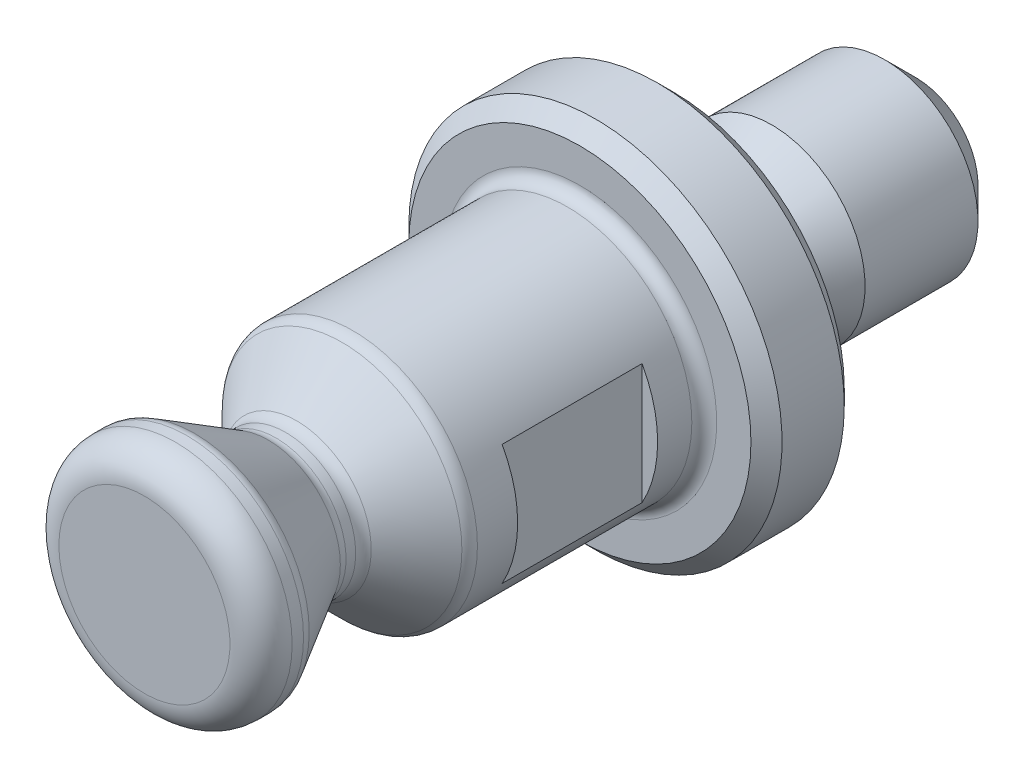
ISO-10303-21;
HEADER;
FILE_DESCRIPTION(('STEP AP214'),'2;1');
FILE_NAME('part.step','',(''),(''),'','','');
FILE_SCHEMA(('AUTOMOTIVE_DESIGN { 1 0 10303 214 1 1 1 1 }'));
ENDSEC;
DATA;
#1=APPLICATION_CONTEXT('core data for automotive mechanical design processes');
#2=APPLICATION_PROTOCOL_DEFINITION('international standard','automotive_design',2000,#1);
#3=PRODUCT_CONTEXT('',#1,'mechanical');
#4=PRODUCT('Part','Part','',(#3));
#5=PRODUCT_RELATED_PRODUCT_CATEGORY('part','',(#4));
#6=PRODUCT_DEFINITION_FORMATION('','',#4);
#7=PRODUCT_DEFINITION_CONTEXT('part definition',#1,'design');
#8=PRODUCT_DEFINITION('design','',#6,#7);
#9=PRODUCT_DEFINITION_SHAPE('','',#8);
#10=(LENGTH_UNIT() NAMED_UNIT(*) SI_UNIT(.MILLI.,.METRE.));
#11=(NAMED_UNIT(*) PLANE_ANGLE_UNIT() SI_UNIT($,.RADIAN.));
#12=(NAMED_UNIT(*) SI_UNIT($,.STERADIAN.) SOLID_ANGLE_UNIT());
#13=UNCERTAINTY_MEASURE_WITH_UNIT(LENGTH_MEASURE(1.E-05),#10,'distance_accuracy_value','');
#14=(GEOMETRIC_REPRESENTATION_CONTEXT(3) GLOBAL_UNCERTAINTY_ASSIGNED_CONTEXT((#13)) GLOBAL_UNIT_ASSIGNED_CONTEXT((#10,
#11,#12)) REPRESENTATION_CONTEXT('',''));
#15=CARTESIAN_POINT('',(0.,0.,0.));
#16=DIRECTION('',(0.,0.,1.));
#17=DIRECTION('',(1.,0.,0.));
#18=AXIS2_PLACEMENT_3D('',#15,#16,#17);
#19=CARTESIAN_POINT('',(0.,0.,-6.8));
#20=DIRECTION('',(0.,0.,1.));
#21=DIRECTION('',(1.,0.,0.));
#22=AXIS2_PLACEMENT_3D('',#19,#20,#21);
#23=CONICAL_SURFACE('',#22,3.,0.785398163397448);
#24=CARTESIAN_POINT('',(0.,0.,-7.8));
#25=DIRECTION('',(0.,0.,-1.));
#26=DIRECTION('',(-1.,0.,0.));
#27=AXIS2_PLACEMENT_3D('',#24,#25,#26);
#28=CIRCLE('',#27,2.);
#29=CARTESIAN_POINT('',(-1.99999999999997,0.,-7.80000000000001));
#30=VERTEX_POINT('',#29);
#31=EDGE_CURVE('E151',#30,#30,#28,.T.);
#32=ORIENTED_EDGE('',*,*,#31,.F.);
#33=EDGE_LOOP('',(#32));
#34=FACE_BOUND('',#33,.T.);
#35=CARTESIAN_POINT('',(0.,0.,-6.8));
#36=DIRECTION('',(0.,0.,-1.));
#37=DIRECTION('',(-1.,0.,0.));
#38=AXIS2_PLACEMENT_3D('',#35,#36,#37);
#39=CIRCLE('',#38,3.);
#40=CARTESIAN_POINT('',(-2.99999999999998,0.,-6.80000000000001));
#41=VERTEX_POINT('',#40);
#42=EDGE_CURVE('E141',#41,#41,#39,.T.);
#43=ORIENTED_EDGE('',*,*,#42,.T.);
#44=EDGE_LOOP('',(#43));
#45=FACE_BOUND('',#44,.T.);
#46=ADVANCED_FACE('F14',(#34,#45),#23,.T.);
#47=CARTESIAN_POINT('',(0.,2.,-7.8));
#48=DIRECTION('',(0.,0.,1.));
#49=DIRECTION('',(1.,0.,0.));
#50=AXIS2_PLACEMENT_3D('',#47,#48,#49);
#51=PLANE('',#50);
#52=ORIENTED_EDGE('',*,*,#31,.T.);
#53=EDGE_LOOP('',(#52));
#54=FACE_BOUND('',#53,.T.);
#55=ADVANCED_FACE('F208',(#54),#51,.F.);
#56=CARTESIAN_POINT('',(0.,0.,17.));
#57=DIRECTION('',(0.,0.,-1.));
#58=DIRECTION('',(-1.,0.,0.));
#59=AXIS2_PLACEMENT_3D('',#56,#57,#58);
#60=PLANE('',#59);
#61=CARTESIAN_POINT('',(0.,0.,17.));
#62=DIRECTION('',(0.,0.,-1.));
#63=DIRECTION('',(-1.,0.,0.));
#64=AXIS2_PLACEMENT_3D('',#61,#62,#63);
#65=CIRCLE('',#64,2.75);
#66=CARTESIAN_POINT('',(-2.75000000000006,0.,17.));
#67=VERTEX_POINT('',#66);
#68=EDGE_CURVE('E157',#67,#67,#65,.F.);
#69=ORIENTED_EDGE('',*,*,#68,.T.);
#70=EDGE_LOOP('',(#69));
#71=FACE_BOUND('',#70,.T.);
#72=ADVANCED_FACE('F215',(#71),#60,.F.);
#73=CARTESIAN_POINT('',(1.58513252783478E-13,0.,-45.4));
#74=DIRECTION('',(0.,0.,-1.));
#75=DIRECTION('',(-1.,0.,0.));
#76=AXIS2_PLACEMENT_3D('',#73,#74,#75);
#77=CYLINDRICAL_SURFACE('',#76,3.75);
#78=CARTESIAN_POINT('',(0.,0.,15.6339745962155));
#79=DIRECTION('',(0.,0.,1.));
#80=DIRECTION('',(1.,0.,0.));
#81=AXIS2_PLACEMENT_3D('',#78,#79,#80);
#82=CIRCLE('',#81,3.75);
#83=CARTESIAN_POINT('',(3.74999999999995,0.,15.6339745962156));
#84=VERTEX_POINT('',#83);
#85=EDGE_CURVE('E181',#84,#84,#82,.T.);
#86=ORIENTED_EDGE('',*,*,#85,.T.);
#87=EDGE_LOOP('',(#86));
#88=FACE_BOUND('',#87,.T.);
#89=CARTESIAN_POINT('',(0.,0.,16.));
#90=DIRECTION('',(0.,0.,-1.));
#91=DIRECTION('',(-1.,0.,0.));
#92=AXIS2_PLACEMENT_3D('',#89,#90,#91);
#93=CIRCLE('',#92,3.75);
#94=CARTESIAN_POINT('',(-3.75000000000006,0.,16.));
#95=VERTEX_POINT('',#94);
#96=EDGE_CURVE('E154',#95,#95,#93,.T.);
#97=ORIENTED_EDGE('',*,*,#96,.T.);
#98=EDGE_LOOP('',(#97));
#99=FACE_BOUND('',#98,.T.);
#100=ADVANCED_FACE('F251',(#88,#99),#77,.T.);
#101=CARTESIAN_POINT('',(0.,0.,15.5));
#102=DIRECTION('',(0.,0.,1.));
#103=DIRECTION('',(1.,0.,0.));
#104=AXIS2_PLACEMENT_3D('',#101,#102,#103);
#105=CONICAL_SURFACE('',#104,3.75,0.523598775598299);
#106=CARTESIAN_POINT('',(0.,0.,13.0179491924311));
#107=DIRECTION('',(0.,0.,1.));
#108=DIRECTION('',(1.,0.,0.));
#109=AXIS2_PLACEMENT_3D('',#106,#107,#108);
#110=CIRCLE('',#109,2.31698729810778);
#111=CARTESIAN_POINT('',(2.31698729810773,0.,13.0179491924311));
#112=VERTEX_POINT('',#111);
#113=EDGE_CURVE('E178',#112,#112,#110,.T.);
#114=ORIENTED_EDGE('',*,*,#113,.T.);
#115=EDGE_LOOP('',(#114));
#116=FACE_BOUND('',#115,.T.);
#117=CARTESIAN_POINT('',(0.,0.,15.3839745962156));
#118=DIRECTION('',(0.,0.,-1.));
#119=DIRECTION('',(-1.,0.,0.));
#120=AXIS2_PLACEMENT_3D('',#117,#118,#119);
#121=CIRCLE('',#120,3.68301270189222);
#122=CARTESIAN_POINT('',(-3.68301270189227,0.,15.3839745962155));
#123=VERTEX_POINT('',#122);
#124=EDGE_CURVE('E175',#123,#123,#121,.T.);
#125=ORIENTED_EDGE('',*,*,#124,.T.);
#126=EDGE_LOOP('',(#125));
#127=FACE_BOUND('',#126,.T.);
#128=ADVANCED_FACE('F248',(#116,#127),#105,.T.);
#129=CARTESIAN_POINT('',(1.58513252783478E-13,0.,-45.4));
#130=DIRECTION('',(0.,0.,-1.));
#131=DIRECTION('',(-1.,0.,0.));
#132=AXIS2_PLACEMENT_3D('',#129,#130,#131);
#133=CYLINDRICAL_SURFACE('',#132,2.25);
#134=CARTESIAN_POINT('',(0.,0.,12.4571067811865));
#135=DIRECTION('',(0.,0.,-1.));
#136=DIRECTION('',(-1.,0.,0.));
#137=AXIS2_PLACEMENT_3D('',#134,#135,#136);
#138=CIRCLE('',#137,2.25);
#139=CARTESIAN_POINT('',(-2.25000000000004,0.,12.4571067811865));
#140=VERTEX_POINT('',#139);
#141=EDGE_CURVE('E172',#140,#140,#138,.F.);
#142=ORIENTED_EDGE('',*,*,#141,.T.);
#143=EDGE_LOOP('',(#142));
#144=FACE_BOUND('',#143,.T.);
#145=CARTESIAN_POINT('',(0.,0.,12.7679491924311));
#146=DIRECTION('',(0.,0.,-1.));
#147=DIRECTION('',(-1.,0.,0.));
#148=AXIS2_PLACEMENT_3D('',#145,#146,#147);
#149=CIRCLE('',#148,2.25);
#150=CARTESIAN_POINT('',(-2.25000000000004,0.,12.7679491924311));
#151=VERTEX_POINT('',#150);
#152=EDGE_CURVE('E169',#151,#151,#149,.T.);
#153=ORIENTED_EDGE('',*,*,#152,.T.);
#154=EDGE_LOOP('',(#153));
#155=FACE_BOUND('',#154,.T.);
#156=ADVANCED_FACE('F250',(#144,#155),#133,.T.);
#157=CARTESIAN_POINT('',(0.,0.,12.25));
#158=DIRECTION('',(0.,0.,-1.));
#159=DIRECTION('',(-1.,0.,0.));
#160=AXIS2_PLACEMENT_3D('',#157,#158,#159);
#161=CONICAL_SURFACE('',#160,2.25,0.78539816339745);
#162=CARTESIAN_POINT('',(0.,0.,10.6464466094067));
#163=DIRECTION('',(0.,0.,1.));
#164=DIRECTION('',(1.,0.,0.));
#165=AXIS2_PLACEMENT_3D('',#162,#163,#164);
#166=CIRCLE('',#165,3.85355339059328);
#167=CARTESIAN_POINT('',(3.85355339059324,0.,10.6464466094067));
#168=VERTEX_POINT('',#167);
#169=EDGE_CURVE('E166',#168,#168,#166,.T.);
#170=ORIENTED_EDGE('',*,*,#169,.T.);
#171=EDGE_LOOP('',(#170));
#172=FACE_BOUND('',#171,.T.);
#173=CARTESIAN_POINT('',(0.,0.,12.1035533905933));
#174=DIRECTION('',(0.,0.,-1.));
#175=DIRECTION('',(-1.,0.,0.));
#176=AXIS2_PLACEMENT_3D('',#173,#174,#175);
#177=CIRCLE('',#176,2.39644660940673);
#178=CARTESIAN_POINT('',(-2.39644660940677,0.,12.1035533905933));
#179=VERTEX_POINT('',#178);
#180=EDGE_CURVE('E163',#179,#179,#177,.T.);
#181=ORIENTED_EDGE('',*,*,#180,.T.);
#182=EDGE_LOOP('',(#181));
#183=FACE_BOUND('',#182,.T.);
#184=ADVANCED_FACE('F259',(#172,#183),#161,.T.);
#185=CARTESIAN_POINT('',(1.58513252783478E-13,0.,-45.4));
#186=DIRECTION('',(0.,0.,-1.));
#187=DIRECTION('',(-1.,0.,0.));
#188=AXIS2_PLACEMENT_3D('',#185,#186,#187);
#189=CYLINDRICAL_SURFACE('',#188,4.);
#190=DIRECTION('',(0.,0.,-1.));
#191=VECTOR('',#190,1.);
#192=CARTESIAN_POINT('',(-3.49999999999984,1.93649167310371,-45.4));
#193=LINE('',#192,#191);
#194=CARTESIAN_POINT('',(-3.5,1.93649167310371,4.5));
#195=VERTEX_POINT('',#194);
#196=CARTESIAN_POINT('',(-3.5,1.93649167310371,9.));
#197=VERTEX_POINT('',#196);
#198=EDGE_CURVE('E66',#195,#197,#193,.F.);
#199=ORIENTED_EDGE('',*,*,#198,.T.);
#200=CARTESIAN_POINT('',(0.,0.,9.));
#201=DIRECTION('',(0.,0.,1.));
#202=DIRECTION('',(1.,0.,0.));
#203=AXIS2_PLACEMENT_3D('',#200,#201,#202);
#204=CIRCLE('',#203,4.);
#205=CARTESIAN_POINT('',(-3.5,-1.93649167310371,9.));
#206=VERTEX_POINT('',#205);
#207=EDGE_CURVE('E54',#197,#206,#204,.T.);
#208=ORIENTED_EDGE('',*,*,#207,.T.);
#209=DIRECTION('',(0.,0.,-1.));
#210=VECTOR('',#209,1.);
#211=CARTESIAN_POINT('',(-3.49999999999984,-1.93649167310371,-45.4));
#212=LINE('',#211,#210);
#213=CARTESIAN_POINT('',(-3.5,-1.93649167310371,4.5));
#214=VERTEX_POINT('',#213);
#215=EDGE_CURVE('E59',#206,#214,#212,.T.);
#216=ORIENTED_EDGE('',*,*,#215,.T.);
#217=CARTESIAN_POINT('',(0.,0.,4.5));
#218=DIRECTION('',(0.,0.,-1.));
#219=DIRECTION('',(-1.,0.,0.));
#220=AXIS2_PLACEMENT_3D('',#217,#218,#219);
#221=CIRCLE('',#220,4.);
#222=EDGE_CURVE('E72',#214,#195,#221,.T.);
#223=ORIENTED_EDGE('',*,*,#222,.T.);
#224=EDGE_LOOP('',(#199,#208,#216,#223));
#225=FACE_BOUND('',#224,.T.);
#226=CARTESIAN_POINT('',(0.,0.,9.));
#227=DIRECTION('',(0.,0.,1.));
#228=DIRECTION('',(1.,0.,0.));
#229=AXIS2_PLACEMENT_3D('',#226,#227,#228);
#230=CIRCLE('',#229,4.);
#231=CARTESIAN_POINT('',(3.5,-1.93649167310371,9.));
#232=VERTEX_POINT('',#231);
#233=CARTESIAN_POINT('',(3.5,1.93649167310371,9.));
#234=VERTEX_POINT('',#233);
#235=EDGE_CURVE('E128',#232,#234,#230,.T.);
#236=ORIENTED_EDGE('',*,*,#235,.T.);
#237=DIRECTION('',(0.,0.,-1.));
#238=VECTOR('',#237,1.);
#239=CARTESIAN_POINT('',(3.50000000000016,1.93649167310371,-45.4));
#240=LINE('',#239,#238);
#241=CARTESIAN_POINT('',(3.5,1.93649167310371,4.5));
#242=VERTEX_POINT('',#241);
#243=EDGE_CURVE('E60',#234,#242,#240,.T.);
#244=ORIENTED_EDGE('',*,*,#243,.T.);
#245=CARTESIAN_POINT('',(0.,0.,4.5));
#246=DIRECTION('',(0.,0.,-1.));
#247=DIRECTION('',(-1.,0.,0.));
#248=AXIS2_PLACEMENT_3D('',#245,#246,#247);
#249=CIRCLE('',#248,4.);
#250=CARTESIAN_POINT('',(3.5,-1.93649167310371,4.5));
#251=VERTEX_POINT('',#250);
#252=EDGE_CURVE('E130',#242,#251,#249,.T.);
#253=ORIENTED_EDGE('',*,*,#252,.T.);
#254=DIRECTION('',(0.,0.,-1.));
#255=VECTOR('',#254,1.);
#256=CARTESIAN_POINT('',(3.50000000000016,-1.93649167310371,-45.4));
#257=LINE('',#256,#255);
#258=EDGE_CURVE('E125',#251,#232,#257,.F.);
#259=ORIENTED_EDGE('',*,*,#258,.T.);
#260=EDGE_LOOP('',(#236,#244,#253,#259));
#261=FACE_BOUND('',#260,.T.);
#262=CARTESIAN_POINT('',(0.,0.,3.4));
#263=DIRECTION('',(0.,0.,-1.));
#264=DIRECTION('',(-1.,0.,0.));
#265=AXIS2_PLACEMENT_3D('',#262,#263,#264);
#266=CIRCLE('',#265,4.);
#267=CARTESIAN_POINT('',(-4.00000000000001,0.,3.39999999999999));
#268=VERTEX_POINT('',#267);
#269=EDGE_CURVE('E116',#268,#268,#266,.F.);
#270=ORIENTED_EDGE('',*,*,#269,.T.);
#271=EDGE_LOOP('',(#270));
#272=FACE_BOUND('',#271,.T.);
#273=CARTESIAN_POINT('',(0.,0.,10.2928932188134));
#274=DIRECTION('',(0.,0.,1.));
#275=DIRECTION('',(1.,0.,0.));
#276=AXIS2_PLACEMENT_3D('',#273,#274,#275);
#277=CIRCLE('',#276,4.);
#278=CARTESIAN_POINT('',(3.99999999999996,0.,10.2928932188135));
#279=VERTEX_POINT('',#278);
#280=EDGE_CURVE('E160',#279,#279,#277,.F.);
#281=ORIENTED_EDGE('',*,*,#280,.T.);
#282=EDGE_LOOP('',(#281));
#283=FACE_BOUND('',#282,.T.);
#284=ADVANCED_FACE('F70',(#225,#261,#272,#283),#189,.T.);
#285=CARTESIAN_POINT('',(0.,6.,3.));
#286=DIRECTION('',(0.,0.,-1.));
#287=DIRECTION('',(-1.,0.,0.));
#288=AXIS2_PLACEMENT_3D('',#285,#286,#287);
#289=PLANE('',#288);
#290=CARTESIAN_POINT('',(0.,0.,3.));
#291=DIRECTION('',(0.,0.,-1.));
#292=DIRECTION('',(-1.,0.,0.));
#293=AXIS2_PLACEMENT_3D('',#290,#291,#292);
#294=CIRCLE('',#293,5.5);
#295=CARTESIAN_POINT('',(-5.50000000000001,0.,2.99999999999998));
#296=VERTEX_POINT('',#295);
#297=EDGE_CURVE('E22',#296,#296,#294,.F.);
#298=ORIENTED_EDGE('',*,*,#297,.T.);
#299=EDGE_LOOP('',(#298));
#300=FACE_BOUND('',#299,.T.);
#301=CARTESIAN_POINT('',(0.,0.,3.));
#302=DIRECTION('',(0.,0.,-1.));
#303=DIRECTION('',(-1.,0.,0.));
#304=AXIS2_PLACEMENT_3D('',#301,#302,#303);
#305=CIRCLE('',#304,4.4);
#306=CARTESIAN_POINT('',(-4.40000000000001,0.,2.99999999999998));
#307=VERTEX_POINT('',#306);
#308=EDGE_CURVE('E112',#307,#307,#305,.T.);
#309=ORIENTED_EDGE('',*,*,#308,.T.);
#310=EDGE_LOOP('',(#309));
#311=FACE_BOUND('',#310,.T.);
#312=ADVANCED_FACE('F85',(#300,#311),#289,.F.);
#313=CARTESIAN_POINT('',(1.58513252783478E-13,0.,-45.4));
#314=DIRECTION('',(0.,0.,-1.));
#315=DIRECTION('',(-1.,0.,0.));
#316=AXIS2_PLACEMENT_3D('',#313,#314,#315);
#317=CYLINDRICAL_SURFACE('',#316,6.);
#318=CARTESIAN_POINT('',(0.,0.,2.5));
#319=DIRECTION('',(0.,0.,-1.));
#320=DIRECTION('',(-1.,0.,0.));
#321=AXIS2_PLACEMENT_3D('',#318,#319,#320);
#322=CIRCLE('',#321,6.);
#323=CARTESIAN_POINT('',(-6.00000000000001,0.,2.49999999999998));
#324=VERTEX_POINT('',#323);
#325=EDGE_CURVE('E76',#324,#324,#322,.T.);
#326=ORIENTED_EDGE('',*,*,#325,.T.);
#327=EDGE_LOOP('',(#326));
#328=FACE_BOUND('',#327,.T.);
#329=CARTESIAN_POINT('',(0.,0.,0.500000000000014));
#330=DIRECTION('',(0.,0.,1.));
#331=DIRECTION('',(1.,0.,0.));
#332=AXIS2_PLACEMENT_3D('',#329,#330,#331);
#333=CIRCLE('',#332,6.);
#334=CARTESIAN_POINT('',(6.,0.,0.500000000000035));
#335=VERTEX_POINT('',#334);
#336=EDGE_CURVE('E73',#335,#335,#333,.T.);
#337=ORIENTED_EDGE('',*,*,#336,.T.);
#338=EDGE_LOOP('',(#337));
#339=FACE_BOUND('',#338,.T.);
#340=ADVANCED_FACE('F93',(#328,#339),#317,.T.);
#341=CARTESIAN_POINT('',(0.,6.,0.));
#342=DIRECTION('',(0.,0.,1.));
#343=DIRECTION('',(1.,0.,0.));
#344=AXIS2_PLACEMENT_3D('',#341,#342,#343);
#345=PLANE('',#344);
#346=CARTESIAN_POINT('',(0.,0.,0.));
#347=DIRECTION('',(0.,0.,1.));
#348=DIRECTION('',(1.,0.,0.));
#349=AXIS2_PLACEMENT_3D('',#346,#347,#348);
#350=CIRCLE('',#349,5.5);
#351=CARTESIAN_POINT('',(5.5,0.,0.));
#352=VERTEX_POINT('',#351);
#353=EDGE_CURVE('E9',#352,#352,#350,.F.);
#354=ORIENTED_EDGE('',*,*,#353,.T.);
#355=EDGE_LOOP('',(#354));
#356=FACE_BOUND('',#355,.T.);
#357=CARTESIAN_POINT('',(0.,0.,0.));
#358=DIRECTION('',(0.,0.,1.));
#359=DIRECTION('',(1.,0.,0.));
#360=AXIS2_PLACEMENT_3D('',#357,#358,#359);
#361=CIRCLE('',#360,2.8);
#362=CARTESIAN_POINT('',(2.8,0.,0.));
#363=VERTEX_POINT('',#362);
#364=EDGE_CURVE('E110',#363,#363,#361,.T.);
#365=ORIENTED_EDGE('',*,*,#364,.T.);
#366=EDGE_LOOP('',(#365));
#367=FACE_BOUND('',#366,.T.);
#368=ADVANCED_FACE('F96',(#356,#367),#345,.F.);
#369=CARTESIAN_POINT('',(1.58513252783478E-13,0.,-45.4));
#370=DIRECTION('',(0.,0.,-1.));
#371=DIRECTION('',(-1.,0.,0.));
#372=AXIS2_PLACEMENT_3D('',#369,#370,#371);
#373=CYLINDRICAL_SURFACE('',#372,2.2);
#374=CARTESIAN_POINT('',(0.,0.,-1.45595274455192));
#375=DIRECTION('',(0.,0.,-1.));
#376=DIRECTION('',(-1.,0.,0.));
#377=AXIS2_PLACEMENT_3D('',#374,#375,#376);
#378=CIRCLE('',#377,2.2);
#379=CARTESIAN_POINT('',(-2.19999999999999,0.,-1.45595274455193));
#380=VERTEX_POINT('',#379);
#381=EDGE_CURVE('E113',#380,#380,#378,.F.);
#382=ORIENTED_EDGE('',*,*,#381,.T.);
#383=EDGE_LOOP('',(#382));
#384=FACE_BOUND('',#383,.T.);
#385=CARTESIAN_POINT('',(0.,0.,-0.6));
#386=DIRECTION('',(0.,0.,1.));
#387=DIRECTION('',(1.,0.,0.));
#388=AXIS2_PLACEMENT_3D('',#385,#386,#387);
#389=CIRCLE('',#388,2.2);
#390=CARTESIAN_POINT('',(2.2,0.,-0.599999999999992));
#391=VERTEX_POINT('',#390);
#392=EDGE_CURVE('E119',#391,#391,#389,.F.);
#393=ORIENTED_EDGE('',*,*,#392,.T.);
#394=EDGE_LOOP('',(#393));
#395=FACE_BOUND('',#394,.T.);
#396=ADVANCED_FACE('F106',(#384,#395),#373,.T.);
#397=CARTESIAN_POINT('',(0.,0.,-1.6));
#398=DIRECTION('',(0.,0.,-1.));
#399=DIRECTION('',(-1.,0.,0.));
#400=AXIS2_PLACEMENT_3D('',#397,#398,#399);
#401=CONICAL_SURFACE('',#400,2.2,0.471238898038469);
#402=CARTESIAN_POINT('',(0.,0.,-1.72834704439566));
#403=DIRECTION('',(0.,0.,-1.));
#404=DIRECTION('',(-1.,0.,0.));
#405=AXIS2_PLACEMENT_3D('',#402,#403,#404);
#406=CIRCLE('',#405,2.26539608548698);
#407=CARTESIAN_POINT('',(-2.26539608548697,0.,-1.72834704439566));
#408=VERTEX_POINT('',#407);
#409=EDGE_CURVE('E184',#408,#408,#406,.T.);
#410=ORIENTED_EDGE('',*,*,#409,.T.);
#411=EDGE_LOOP('',(#410));
#412=FACE_BOUND('',#411,.T.);
#413=CARTESIAN_POINT('',(0.,0.,-3.17008840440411));
#414=DIRECTION('',(0.,0.,-1.));
#415=DIRECTION('',(-1.,0.,0.));
#416=AXIS2_PLACEMENT_3D('',#413,#414,#415);
#417=CIRCLE('',#416,3.);
#418=CARTESIAN_POINT('',(-2.99999999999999,0.,-3.17008840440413));
#419=VERTEX_POINT('',#418);
#420=EDGE_CURVE('E144',#419,#419,#417,.T.);
#421=ORIENTED_EDGE('',*,*,#420,.F.);
#422=EDGE_LOOP('',(#421));
#423=FACE_BOUND('',#422,.T.);
#424=ADVANCED_FACE('F431',(#412,#423),#401,.T.);
#425=CARTESIAN_POINT('',(1.58513252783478E-13,0.,-45.4));
#426=DIRECTION('',(0.,0.,-1.));
#427=DIRECTION('',(-1.,0.,0.));
#428=AXIS2_PLACEMENT_3D('',#425,#426,#427);
#429=CYLINDRICAL_SURFACE('',#428,3.);
#430=ORIENTED_EDGE('',*,*,#42,.F.);
#431=EDGE_LOOP('',(#430));
#432=FACE_BOUND('',#431,.T.);
#433=ORIENTED_EDGE('',*,*,#420,.T.);
#434=EDGE_LOOP('',(#433));
#435=FACE_BOUND('',#434,.T.);
#436=ADVANCED_FACE('F226',(#432,#435),#429,.T.);
#437=CARTESIAN_POINT('',(0.,0.,16.));
#438=DIRECTION('',(0.,0.,-1.));
#439=DIRECTION('',(-1.,0.,0.));
#440=AXIS2_PLACEMENT_3D('',#437,#438,#439);
#441=TOROIDAL_SURFACE('',#440,2.75,1.);
#442=ORIENTED_EDGE('',*,*,#68,.F.);
#443=EDGE_LOOP('',(#442));
#444=FACE_BOUND('',#443,.T.);
#445=ORIENTED_EDGE('',*,*,#96,.F.);
#446=EDGE_LOOP('',(#445));
#447=FACE_BOUND('',#446,.T.);
#448=ADVANCED_FACE('F222',(#444,#447),#441,.T.);
#449=CARTESIAN_POINT('',(0.,0.,10.2928932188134));
#450=DIRECTION('',(0.,0.,1.));
#451=DIRECTION('',(1.,0.,0.));
#452=AXIS2_PLACEMENT_3D('',#449,#450,#451);
#453=TOROIDAL_SURFACE('',#452,3.5,0.5);
#454=ORIENTED_EDGE('',*,*,#169,.F.);
#455=EDGE_LOOP('',(#454));
#456=FACE_BOUND('',#455,.T.);
#457=ORIENTED_EDGE('',*,*,#280,.F.);
#458=EDGE_LOOP('',(#457));
#459=FACE_BOUND('',#458,.T.);
#460=ADVANCED_FACE('F225',(#456,#459),#453,.T.);
#461=CARTESIAN_POINT('',(0.,0.,12.4571067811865));
#462=DIRECTION('',(0.,0.,-1.));
#463=DIRECTION('',(-1.,0.,0.));
#464=AXIS2_PLACEMENT_3D('',#461,#462,#463);
#465=TOROIDAL_SURFACE('',#464,2.75,0.5);
#466=ORIENTED_EDGE('',*,*,#141,.F.);
#467=EDGE_LOOP('',(#466));
#468=FACE_BOUND('',#467,.T.);
#469=ORIENTED_EDGE('',*,*,#180,.F.);
#470=EDGE_LOOP('',(#469));
#471=FACE_BOUND('',#470,.T.);
#472=ADVANCED_FACE('F230',(#468,#471),#465,.F.);
#473=CARTESIAN_POINT('',(0.,0.,12.7679491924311));
#474=DIRECTION('',(0.,0.,-1.));
#475=DIRECTION('',(-1.,0.,0.));
#476=AXIS2_PLACEMENT_3D('',#473,#474,#475);
#477=TOROIDAL_SURFACE('',#476,2.75,0.5);
#478=ORIENTED_EDGE('',*,*,#113,.F.);
#479=EDGE_LOOP('',(#478));
#480=FACE_BOUND('',#479,.T.);
#481=ORIENTED_EDGE('',*,*,#152,.F.);
#482=EDGE_LOOP('',(#481));
#483=FACE_BOUND('',#482,.T.);
#484=ADVANCED_FACE('F234',(#480,#483),#477,.F.);
#485=CARTESIAN_POINT('',(0.,0.,15.6339745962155));
#486=DIRECTION('',(0.,0.,1.));
#487=DIRECTION('',(1.,0.,0.));
#488=AXIS2_PLACEMENT_3D('',#485,#486,#487);
#489=TOROIDAL_SURFACE('',#488,3.25,0.5);
#490=ORIENTED_EDGE('',*,*,#85,.F.);
#491=EDGE_LOOP('',(#490));
#492=FACE_BOUND('',#491,.T.);
#493=ORIENTED_EDGE('',*,*,#124,.F.);
#494=EDGE_LOOP('',(#493));
#495=FACE_BOUND('',#494,.T.);
#496=ADVANCED_FACE('F204',(#492,#495),#489,.T.);
#497=CARTESIAN_POINT('',(0.,0.,-1.45595274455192));
#498=DIRECTION('',(0.,0.,-1.));
#499=DIRECTION('',(-1.,0.,0.));
#500=AXIS2_PLACEMENT_3D('',#497,#498,#499);
#501=TOROIDAL_SURFACE('',#500,2.8,0.6);
#502=ORIENTED_EDGE('',*,*,#381,.F.);
#503=EDGE_LOOP('',(#502));
#504=FACE_BOUND('',#503,.T.);
#505=ORIENTED_EDGE('',*,*,#409,.F.);
#506=EDGE_LOOP('',(#505));
#507=FACE_BOUND('',#506,.T.);
#508=ADVANCED_FACE('F193',(#504,#507),#501,.F.);
#509=CARTESIAN_POINT('',(0.,0.,-0.6));
#510=DIRECTION('',(0.,0.,1.));
#511=DIRECTION('',(1.,0.,0.));
#512=AXIS2_PLACEMENT_3D('',#509,#510,#511);
#513=TOROIDAL_SURFACE('',#512,2.8,0.6);
#514=ORIENTED_EDGE('',*,*,#364,.F.);
#515=EDGE_LOOP('',(#514));
#516=FACE_BOUND('',#515,.T.);
#517=ORIENTED_EDGE('',*,*,#392,.F.);
#518=EDGE_LOOP('',(#517));
#519=FACE_BOUND('',#518,.T.);
#520=ADVANCED_FACE('F190',(#516,#519),#513,.F.);
#521=CARTESIAN_POINT('',(0.,0.,3.4));
#522=DIRECTION('',(0.,0.,-1.));
#523=DIRECTION('',(-1.,0.,0.));
#524=AXIS2_PLACEMENT_3D('',#521,#522,#523);
#525=TOROIDAL_SURFACE('',#524,4.4,0.4);
#526=ORIENTED_EDGE('',*,*,#269,.F.);
#527=EDGE_LOOP('',(#526));
#528=FACE_BOUND('',#527,.T.);
#529=ORIENTED_EDGE('',*,*,#308,.F.);
#530=EDGE_LOOP('',(#529));
#531=FACE_BOUND('',#530,.T.);
#532=ADVANCED_FACE('F192',(#528,#531),#525,.F.);
#533=CARTESIAN_POINT('',(3.5,-6.,4.5));
#534=DIRECTION('',(0.,0.,-1.));
#535=DIRECTION('',(-1.,0.,0.));
#536=AXIS2_PLACEMENT_3D('',#533,#534,#535);
#537=PLANE('',#536);
#538=DIRECTION('',(0.,1.,0.));
#539=VECTOR('',#538,1.);
#540=CARTESIAN_POINT('',(3.5,-6.,4.5));
#541=LINE('',#540,#539);
#542=EDGE_CURVE('E138',#251,#242,#541,.T.);
#543=ORIENTED_EDGE('',*,*,#542,.F.);
#544=ORIENTED_EDGE('',*,*,#252,.F.);
#545=EDGE_LOOP('',(#543,#544));
#546=FACE_BOUND('',#545,.T.);
#547=ADVANCED_FACE('F201',(#546),#537,.F.);
#548=CARTESIAN_POINT('',(3.5,-6.,9.));
#549=DIRECTION('',(0.,0.,1.));
#550=DIRECTION('',(1.,0.,0.));
#551=AXIS2_PLACEMENT_3D('',#548,#549,#550);
#552=PLANE('',#551);
#553=ORIENTED_EDGE('',*,*,#235,.F.);
#554=DIRECTION('',(0.,1.,0.));
#555=VECTOR('',#554,1.);
#556=CARTESIAN_POINT('',(3.5,-6.,9.));
#557=LINE('',#556,#555);
#558=EDGE_CURVE('E36',#232,#234,#557,.T.);
#559=ORIENTED_EDGE('',*,*,#558,.T.);
#560=EDGE_LOOP('',(#553,#559));
#561=FACE_BOUND('',#560,.T.);
#562=ADVANCED_FACE('F140',(#561),#552,.F.);
#563=CARTESIAN_POINT('',(3.5,-6.,4.5));
#564=DIRECTION('',(-1.,0.,0.));
#565=DIRECTION('',(0.,0.,1.));
#566=AXIS2_PLACEMENT_3D('',#563,#564,#565);
#567=PLANE('',#566);
#568=ORIENTED_EDGE('',*,*,#558,.F.);
#569=ORIENTED_EDGE('',*,*,#258,.F.);
#570=ORIENTED_EDGE('',*,*,#542,.T.);
#571=ORIENTED_EDGE('',*,*,#243,.F.);
#572=EDGE_LOOP('',(#568,#569,#570,#571));
#573=FACE_BOUND('',#572,.T.);
#574=ADVANCED_FACE('F136',(#573),#567,.F.);
#575=CARTESIAN_POINT('',(-3.5,-6.,4.5));
#576=DIRECTION('',(0.,0.,-1.));
#577=DIRECTION('',(-1.,0.,0.));
#578=AXIS2_PLACEMENT_3D('',#575,#576,#577);
#579=PLANE('',#578);
#580=ORIENTED_EDGE('',*,*,#222,.F.);
#581=DIRECTION('',(0.,1.,0.));
#582=VECTOR('',#581,1.);
#583=CARTESIAN_POINT('',(-3.5,-6.,4.5));
#584=LINE('',#583,#582);
#585=EDGE_CURVE('E68',#214,#195,#584,.T.);
#586=ORIENTED_EDGE('',*,*,#585,.T.);
#587=EDGE_LOOP('',(#580,#586));
#588=FACE_BOUND('',#587,.T.);
#589=ADVANCED_FACE('F395',(#588),#579,.F.);
#590=CARTESIAN_POINT('',(-3.5,-6.,4.5));
#591=DIRECTION('',(1.,0.,0.));
#592=DIRECTION('',(0.,0.,-1.));
#593=AXIS2_PLACEMENT_3D('',#590,#591,#592);
#594=PLANE('',#593);
#595=DIRECTION('',(0.,1.,0.));
#596=VECTOR('',#595,1.);
#597=CARTESIAN_POINT('',(-3.5,-6.,9.));
#598=LINE('',#597,#596);
#599=EDGE_CURVE('E28',#206,#197,#598,.T.);
#600=ORIENTED_EDGE('',*,*,#599,.T.);
#601=ORIENTED_EDGE('',*,*,#198,.F.);
#602=ORIENTED_EDGE('',*,*,#585,.F.);
#603=ORIENTED_EDGE('',*,*,#215,.F.);
#604=EDGE_LOOP('',(#600,#601,#602,#603));
#605=FACE_BOUND('',#604,.T.);
#606=ADVANCED_FACE('F64',(#605),#594,.F.);
#607=CARTESIAN_POINT('',(-3.5,-6.,9.));
#608=DIRECTION('',(0.,0.,1.));
#609=DIRECTION('',(1.,0.,0.));
#610=AXIS2_PLACEMENT_3D('',#607,#608,#609);
#611=PLANE('',#610);
#612=ORIENTED_EDGE('',*,*,#599,.F.);
#613=ORIENTED_EDGE('',*,*,#207,.F.);
#614=EDGE_LOOP('',(#612,#613));
#615=FACE_BOUND('',#614,.T.);
#616=ADVANCED_FACE('F55',(#615),#611,.F.);
#617=CARTESIAN_POINT('',(0.,0.,2.5));
#618=DIRECTION('',(0.,0.,-1.));
#619=DIRECTION('',(-1.,0.,0.));
#620=AXIS2_PLACEMENT_3D('',#617,#618,#619);
#621=CONICAL_SURFACE('',#620,6.,0.78539816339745);
#622=ORIENTED_EDGE('',*,*,#297,.F.);
#623=EDGE_LOOP('',(#622));
#624=FACE_BOUND('',#623,.T.);
#625=ORIENTED_EDGE('',*,*,#325,.F.);
#626=EDGE_LOOP('',(#625));
#627=FACE_BOUND('',#626,.T.);
#628=ADVANCED_FACE('F88',(#624,#627),#621,.T.);
#629=CARTESIAN_POINT('',(0.,0.,0.));
#630=DIRECTION('',(0.,0.,1.));
#631=DIRECTION('',(1.,0.,0.));
#632=AXIS2_PLACEMENT_3D('',#629,#630,#631);
#633=CONICAL_SURFACE('',#632,5.5,0.785398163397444);
#634=ORIENTED_EDGE('',*,*,#336,.F.);
#635=EDGE_LOOP('',(#634));
#636=FACE_BOUND('',#635,.T.);
#637=ORIENTED_EDGE('',*,*,#353,.F.);
#638=EDGE_LOOP('',(#637));
#639=FACE_BOUND('',#638,.T.);
#640=ADVANCED_FACE('F16',(#636,#639),#633,.T.);
#641=CLOSED_SHELL('',(#46,#55,#72,#100,#128,#156,#184,#284,#312,#340,#368,#396,#424,#436,#448,
#460,#472,#484,#496,#508,#520,#532,#547,#562,#574,#589,#606,#616,#628,#640));
#642=MANIFOLD_SOLID_BREP('B1',#641);
#643=ADVANCED_BREP_SHAPE_REPRESENTATION('',(#18,#642),#14);
#644=SHAPE_DEFINITION_REPRESENTATION(#9,#643);
ENDSEC;
END-ISO-10303-21;
